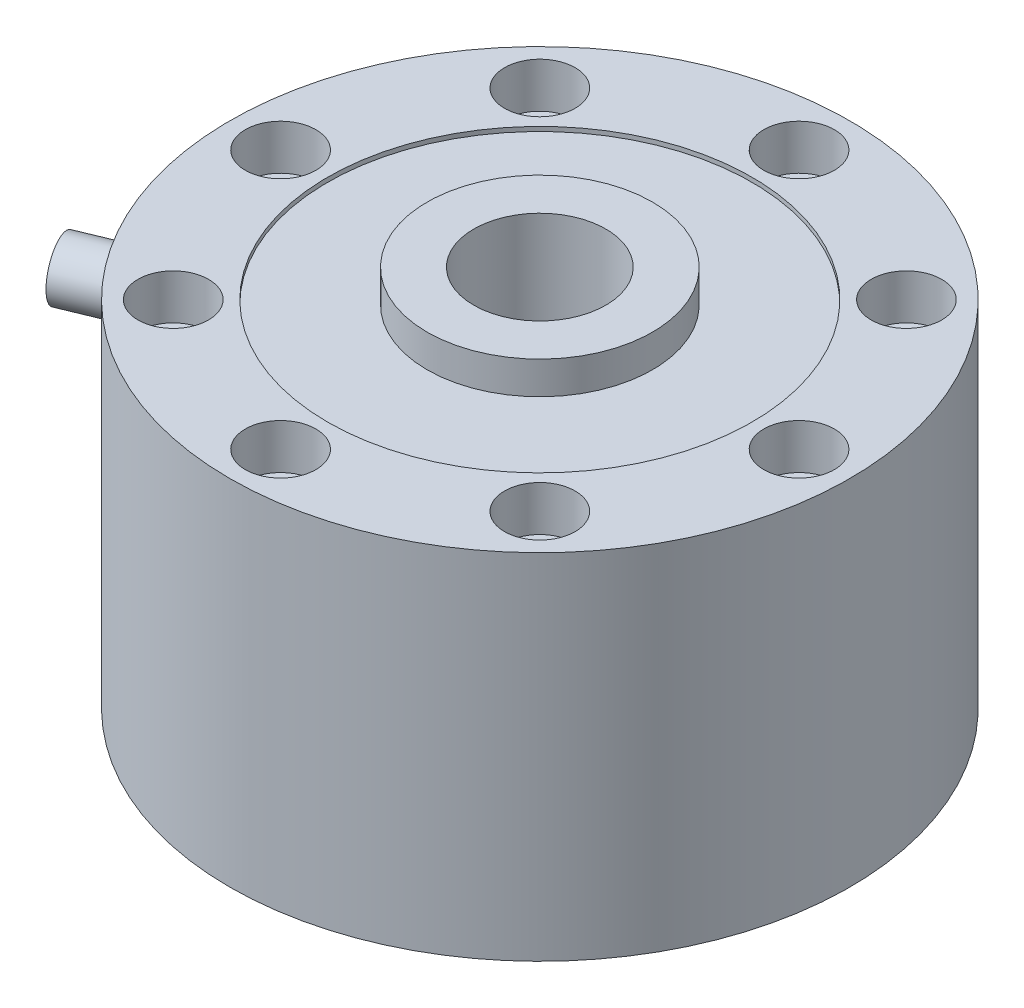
ISO-10303-21;
HEADER;
FILE_DESCRIPTION(('STEP AP214'),'2;1');
FILE_NAME('part.step','',(''),(''),'','','');
FILE_SCHEMA(('AUTOMOTIVE_DESIGN { 1 0 10303 214 1 1 1 1 }'));
ENDSEC;
DATA;
#1=APPLICATION_CONTEXT('core data for automotive mechanical design processes');
#2=APPLICATION_PROTOCOL_DEFINITION('international standard','automotive_design',2000,#1);
#3=PRODUCT_CONTEXT('',#1,'mechanical');
#4=PRODUCT('Part','Part','',(#3));
#5=PRODUCT_RELATED_PRODUCT_CATEGORY('part','',(#4));
#6=PRODUCT_DEFINITION_FORMATION('','',#4);
#7=PRODUCT_DEFINITION_CONTEXT('part definition',#1,'design');
#8=PRODUCT_DEFINITION('design','',#6,#7);
#9=PRODUCT_DEFINITION_SHAPE('','',#8);
#10=(LENGTH_UNIT() NAMED_UNIT(*) SI_UNIT(.MILLI.,.METRE.));
#11=(NAMED_UNIT(*) PLANE_ANGLE_UNIT() SI_UNIT($,.RADIAN.));
#12=(NAMED_UNIT(*) SI_UNIT($,.STERADIAN.) SOLID_ANGLE_UNIT());
#13=UNCERTAINTY_MEASURE_WITH_UNIT(LENGTH_MEASURE(1.E-05),#10,'distance_accuracy_value','');
#14=(GEOMETRIC_REPRESENTATION_CONTEXT(3) GLOBAL_UNCERTAINTY_ASSIGNED_CONTEXT((#13)) GLOBAL_UNIT_ASSIGNED_CONTEXT((#10,
#11,#12)) REPRESENTATION_CONTEXT('',''));
#15=CARTESIAN_POINT('',(0.,0.,0.));
#16=DIRECTION('',(0.,0.,1.));
#17=DIRECTION('',(1.,0.,0.));
#18=AXIS2_PLACEMENT_3D('',#15,#16,#17);
#19=CARTESIAN_POINT('',(0.,79.756,0.));
#20=DIRECTION('',(0.,-1.,0.));
#21=DIRECTION('',(0.,0.,-1.));
#22=AXIS2_PLACEMENT_3D('',#19,#20,#21);
#23=CYLINDRICAL_SURFACE('',#22,69.85);
#24=CARTESIAN_POINT('',(0.,79.756,0.));
#25=DIRECTION('',(0.,1.,0.));
#26=DIRECTION('',(0.,0.,1.));
#27=AXIS2_PLACEMENT_3D('',#24,#25,#26);
#28=CIRCLE('',#27,69.85);
#29=CARTESIAN_POINT('',(0.,79.756,69.85));
#30=VERTEX_POINT('',#29);
#31=EDGE_CURVE('E82',#30,#30,#28,.T.);
#32=ORIENTED_EDGE('',*,*,#31,.F.);
#33=EDGE_LOOP('',(#32));
#34=FACE_BOUND('',#33,.T.);
#35=CARTESIAN_POINT('',(0.,0.,0.));
#36=DIRECTION('',(0.,1.,0.));
#37=DIRECTION('',(0.,0.,1.));
#38=AXIS2_PLACEMENT_3D('',#35,#36,#37);
#39=CIRCLE('',#38,69.85);
#40=CARTESIAN_POINT('',(0.,0.,69.85));
#41=VERTEX_POINT('',#40);
#42=EDGE_CURVE('E81',#41,#41,#39,.T.);
#43=ORIENTED_EDGE('',*,*,#42,.T.);
#44=EDGE_LOOP('',(#43));
#45=FACE_BOUND('',#44,.T.);
#46=CARTESIAN_POINT('',(-66.6958066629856,63.5510919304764,20.7531172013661));
#47=CARTESIAN_POINT('',(-66.6958069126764,63.3730834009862,20.7531155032));
#48=CARTESIAN_POINT('',(-66.6935737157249,63.1951005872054,20.7602972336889));
#49=CARTESIAN_POINT('',(-66.6846432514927,62.8403461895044,20.788965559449));
#50=CARTESIAN_POINT('',(-66.6779448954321,62.6635749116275,20.810455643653));
#51=CARTESIAN_POINT('',(-66.660084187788,62.3124202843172,20.8675961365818));
#52=CARTESIAN_POINT('',(-66.6489182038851,62.1380389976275,20.9032580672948));
#53=CARTESIAN_POINT('',(-66.6221329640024,61.7929838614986,20.9884704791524));
#54=CARTESIAN_POINT('',(-66.6065120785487,61.6223113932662,21.0380260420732));
#55=CARTESIAN_POINT('',(-66.5708595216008,61.2861125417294,21.1505706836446));
#56=CARTESIAN_POINT('',(-66.5508320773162,61.1205813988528,21.2135468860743));
#57=CARTESIAN_POINT('',(-66.5063834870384,60.7956018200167,21.3524887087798));
#58=CARTESIAN_POINT('',(-66.4819607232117,60.6361556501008,21.4284591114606));
#59=CARTESIAN_POINT('',(-66.4287885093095,60.3246223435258,21.5927303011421));
#60=CARTESIAN_POINT('',(-66.4000415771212,60.1725309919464,21.6810239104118));
#61=CARTESIAN_POINT('',(-66.3382613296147,59.8766186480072,21.8693255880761));
#62=CARTESIAN_POINT('',(-66.3052264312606,59.7328007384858,21.9693379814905));
#63=CARTESIAN_POINT('',(-66.2348780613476,59.454178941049,22.1805283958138));
#64=CARTESIAN_POINT('',(-66.1975548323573,59.3193967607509,22.2917318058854));
#65=CARTESIAN_POINT('',(-66.1187820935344,59.0601124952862,22.5243030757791));
#66=CARTESIAN_POINT('',(-66.077331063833,58.9356142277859,22.64567467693));
#67=CARTESIAN_POINT('',(-65.9904600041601,58.6978686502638,22.8975856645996));
#68=CARTESIAN_POINT('',(-65.9450412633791,58.5846177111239,23.0281220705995));
#69=CARTESIAN_POINT('',(-65.8503683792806,58.3700811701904,23.2974647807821));
#70=CARTESIAN_POINT('',(-65.8011128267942,58.2687999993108,23.4362741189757));
#71=CARTESIAN_POINT('',(-65.6989080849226,58.0788412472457,23.7212756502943));
#72=CARTESIAN_POINT('',(-65.6459539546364,57.9901810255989,23.8674776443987));
#73=CARTESIAN_POINT('',(-65.5366296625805,57.8262332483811,24.1660497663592));
#74=CARTESIAN_POINT('',(-65.480258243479,57.7509506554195,24.3184221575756));
#75=CARTESIAN_POINT('',(-65.3644101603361,57.61436757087,24.6281073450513));
#76=CARTESIAN_POINT('',(-65.3049347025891,57.5530616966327,24.785418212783));
#77=CARTESIAN_POINT('',(-65.1831819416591,57.4448218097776,25.1038733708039));
#78=CARTESIAN_POINT('',(-65.120903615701,57.3978930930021,25.2650190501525));
#79=CARTESIAN_POINT('',(-64.9307895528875,57.2795202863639,25.7514142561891));
#80=CARTESIAN_POINT('',(-64.7992228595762,57.2299568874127,26.0808338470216));
#81=CARTESIAN_POINT('',(-64.5298217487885,57.1910708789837,26.7404518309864));
#82=CARTESIAN_POINT('',(-64.3919874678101,57.2017469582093,27.0706502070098));
#83=CARTESIAN_POINT('',(-64.114395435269,57.2828244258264,27.7216809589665));
#84=CARTESIAN_POINT('',(-63.9746445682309,57.3530492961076,28.0425381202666));
#85=CARTESIAN_POINT('',(-63.6972856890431,57.5509772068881,28.6669692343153));
#86=CARTESIAN_POINT('',(-63.5596777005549,57.678680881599,28.9705429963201));
#87=CARTESIAN_POINT('',(-63.2911170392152,57.9881311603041,29.5526650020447));
#88=CARTESIAN_POINT('',(-63.1601743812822,58.1699564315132,29.8311760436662));
#89=CARTESIAN_POINT('',(-62.9099384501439,58.5824329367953,30.3553394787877));
#90=CARTESIAN_POINT('',(-62.7906454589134,58.8130853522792,30.6009910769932));
#91=CARTESIAN_POINT('',(-62.5678919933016,59.3176625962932,31.0539121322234));
#92=CARTESIAN_POINT('',(-62.4644903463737,59.5917409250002,31.2610395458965));
#93=CARTESIAN_POINT('',(-62.2782312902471,60.1748562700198,31.6304813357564));
#94=CARTESIAN_POINT('',(-62.1953739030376,60.4838933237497,31.792795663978));
#95=CARTESIAN_POINT('',(-62.0536862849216,61.1282660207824,32.0684683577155));
#96=CARTESIAN_POINT('',(-61.9948598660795,61.4636058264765,32.1818189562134));
#97=CARTESIAN_POINT('',(-61.9038190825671,62.1510104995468,32.3565987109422));
#98=CARTESIAN_POINT('',(-61.8716040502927,62.503074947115,32.4180291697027));
#99=CARTESIAN_POINT('',(-61.8352840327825,63.2125878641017,32.4872544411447));
#100=CARTESIAN_POINT('',(-61.8310789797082,63.5700125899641,32.4952401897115));
#101=CARTESIAN_POINT('',(-61.8507005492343,64.2812832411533,32.4578768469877));
#102=CARTESIAN_POINT('',(-61.8745268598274,64.6351292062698,32.4125283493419));
#103=CARTESIAN_POINT('',(-61.949087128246,65.3285775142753,32.2697924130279));
#104=CARTESIAN_POINT('',(-61.9997746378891,65.668203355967,32.1724948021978));
#105=CARTESIAN_POINT('',(-62.125825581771,66.3242996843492,31.9284051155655));
#106=CARTESIAN_POINT('',(-62.2011894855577,66.6407697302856,31.7816120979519));
#107=CARTESIAN_POINT('',(-62.3736566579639,67.2425518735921,31.4417831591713));
#108=CARTESIAN_POINT('',(-62.470820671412,67.5277735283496,31.2486179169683));
#109=CARTESIAN_POINT('',(-62.6827973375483,68.0580469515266,30.8211968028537));
#110=CARTESIAN_POINT('',(-62.7976103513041,68.3030978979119,30.586940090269));
#111=CARTESIAN_POINT('',(-63.0407542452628,68.7468103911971,30.0826239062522));
#112=CARTESIAN_POINT('',(-63.1691242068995,68.9453322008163,29.8124603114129));
#113=CARTESIAN_POINT('',(-63.4342988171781,69.2893892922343,29.2439811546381));
#114=CARTESIAN_POINT('',(-63.5711033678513,69.4349251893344,28.9456659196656));
#115=CARTESIAN_POINT('',(-63.8480820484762,69.6686474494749,28.329469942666));
#116=CARTESIAN_POINT('',(-63.9882508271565,69.7569193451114,28.0116191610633));
#117=CARTESIAN_POINT('',(-64.2676366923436,69.8738618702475,27.3645247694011));
#118=CARTESIAN_POINT('',(-64.4068538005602,69.9025338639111,27.0352814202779));
#119=CARTESIAN_POINT('',(-64.6113991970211,69.9002864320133,26.5409422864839));
#120=CARTESIAN_POINT('',(-64.6787846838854,69.8920338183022,26.3762931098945));
#121=CARTESIAN_POINT('',(-64.8118019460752,69.8606304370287,26.0477278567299));
#122=CARTESIAN_POINT('',(-64.8774343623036,69.8374851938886,25.8838115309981));
#123=CARTESIAN_POINT('',(-65.0065431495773,69.7764468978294,25.5578290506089));
#124=CARTESIAN_POINT('',(-65.0700187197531,69.7385484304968,25.3957635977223));
#125=CARTESIAN_POINT('',(-65.1943883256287,69.648298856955,25.0747650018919));
#126=CARTESIAN_POINT('',(-65.2552832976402,69.5959530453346,24.9158307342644));
#127=CARTESIAN_POINT('',(-65.3741895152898,69.4771631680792,24.6021542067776));
#128=CARTESIAN_POINT('',(-65.4321999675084,69.4107152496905,24.4474131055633));
#129=CARTESIAN_POINT('',(-65.5450002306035,69.2642332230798,24.1433579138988));
#130=CARTESIAN_POINT('',(-65.5997912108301,69.1842040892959,23.9940418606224));
#131=CARTESIAN_POINT('',(-65.705936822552,69.0110818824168,23.7018257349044));
#132=CARTESIAN_POINT('',(-65.7572902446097,68.917984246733,23.5589279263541));
#133=CARTESIAN_POINT('',(-65.8563034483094,68.7194413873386,23.2807129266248));
#134=CARTESIAN_POINT('',(-65.9039645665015,68.6140006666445,23.1453929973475));
#135=CARTESIAN_POINT('',(-65.9956073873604,68.3910594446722,22.8827822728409));
#136=CARTESIAN_POINT('',(-66.0395743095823,68.2735143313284,22.7555241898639));
#137=CARTESIAN_POINT('',(-66.1234578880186,68.0275758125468,22.5106101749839));
#138=CARTESIAN_POINT('',(-66.1633760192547,67.899186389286,22.3929507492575));
#139=CARTESIAN_POINT('',(-66.2390824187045,67.6323432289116,22.1680074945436));
#140=CARTESIAN_POINT('',(-66.2748681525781,67.4938833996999,22.0607300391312));
#141=CARTESIAN_POINT('',(-66.3421732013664,67.2079957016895,21.8574933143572));
#142=CARTESIAN_POINT('',(-66.3736940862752,67.0605711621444,21.7615298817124));
#143=CARTESIAN_POINT('',(-66.4324853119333,66.7573601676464,21.5813901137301));
#144=CARTESIAN_POINT('',(-66.4597446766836,66.6015534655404,21.4972442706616));
#145=CARTESIAN_POINT('',(-66.5098503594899,66.2830856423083,21.341719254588));
#146=CARTESIAN_POINT('',(-66.5326982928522,66.1204270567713,21.2703354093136));
#147=CARTESIAN_POINT('',(-66.5739345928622,65.789491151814,21.1409164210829));
#148=CARTESIAN_POINT('',(-66.5923266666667,65.6212186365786,21.0828701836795));
#149=CARTESIAN_POINT('',(-66.6246409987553,65.2801839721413,20.9805287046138));
#150=CARTESIAN_POINT('',(-66.6385643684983,65.1074229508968,20.9362300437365));
#151=CARTESIAN_POINT('',(-66.6654201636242,64.706428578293,20.850584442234));
#152=CARTESIAN_POINT('',(-66.6768139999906,64.477041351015,20.8140726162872));
#153=CARTESIAN_POINT('',(-66.692007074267,64.0154521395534,20.765340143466));
#154=CARTESIAN_POINT('',(-66.6958063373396,63.7832501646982,20.7531194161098));
#155=CARTESIAN_POINT('',(-66.6958066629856,63.5510919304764,20.7531172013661));
#156=B_SPLINE_CURVE_WITH_KNOTS('',3,(#46,#47,#48,#49,#50,#51,#52,#53,#54,#55,#56,#57,#58,#59,
#60,#61,#62,#63,#64,#65,#66,#67,#68,#69,#70,#71,#72,#73,#74,#75,#76,#77,#78,#79,#80,#81,#82,#83,
#84,#85,#86,#87,#88,#89,#90,#91,#92,#93,#94,#95,#96,#97,#98,#99,#100,#101,#102,#103,#104,#105,
#106,#107,#108,#109,#110,#111,#112,#113,#114,#115,#116,#117,#118,#119,#120,#121,#122,#123,#124,
#125,#126,#127,#128,#129,#130,#131,#132,#133,#134,#135,#136,#137,#138,#139,#140,#141,#142,#143,
#144,#145,#146,#147,#148,#149,#150,#151,#152,#153,#154,#155),.UNSPECIFIED.,.T.,.F.,(4,2,2,2,2,2,
2,2,2,2,2,2,2,2,2,2,2,2,2,2,2,2,2,2,2,2,2,2,2,2,2,2,2,2,2,2,2,2,2,2,2,2,2,2,2,2,2,2,2,2,2,2,2,2,
4),(0.,0.533822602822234,1.06777542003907,1.60216324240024,2.13674677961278,2.67081970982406,
3.20508962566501,3.73904964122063,4.27320734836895,4.80860546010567,5.34420144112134,
5.87962403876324,6.41524421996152,6.95159414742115,7.48814262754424,8.02448412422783,
8.56102294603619,9.62995750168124,10.6988687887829,11.7646225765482,12.8303881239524,
13.8977104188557,14.9650585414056,16.0362672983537,17.1074772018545,18.1788569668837,
19.250209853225,20.3177331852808,21.385244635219,22.4509161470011,23.5166079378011,
24.585306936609,25.6540278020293,26.7259182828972,27.7977963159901,28.8680696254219,
29.9383184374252,30.4720878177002,31.0056593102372,31.539426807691,32.0729989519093,
32.6067170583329,33.1402400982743,33.673949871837,34.2074655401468,34.743023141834,
35.2783849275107,35.8140733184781,36.349563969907,36.8864118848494,37.4230628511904,
37.9592657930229,38.4953352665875,39.1915475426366,39.8877575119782),.UNSPECIFIED.);
#157=CARTESIAN_POINT('',(-66.6958066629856,63.5510919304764,20.7531172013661));
#158=VERTEX_POINT('',#157);
#159=EDGE_CURVE('E11',#158,#158,#156,.T.);
#160=ORIENTED_EDGE('',*,*,#159,.F.);
#161=EDGE_LOOP('',(#160));
#162=FACE_BOUND('',#161,.T.);
#163=ADVANCED_FACE('F35',(#34,#45,#162),#23,.T.);
#164=CARTESIAN_POINT('',(-41.3091781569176,-1.26999999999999,-41.3091781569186));
#165=DIRECTION('',(0.,1.,0.));
#166=DIRECTION('',(0.,0.,1.));
#167=AXIS2_PLACEMENT_3D('',#164,#165,#166);
#168=CYLINDRICAL_SURFACE('',#167,5.1562);
#169=CARTESIAN_POINT('',(-41.3091781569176,0.,-41.3091781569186));
#170=DIRECTION('',(0.,1.,0.));
#171=DIRECTION('',(0.,0.,1.));
#172=AXIS2_PLACEMENT_3D('',#169,#170,#171);
#173=CIRCLE('',#172,5.1562);
#174=CARTESIAN_POINT('',(-41.3091781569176,0.,-36.1529781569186));
#175=VERTEX_POINT('',#174);
#176=EDGE_CURVE('E96',#175,#175,#173,.T.);
#177=ORIENTED_EDGE('',*,*,#176,.F.);
#178=EDGE_LOOP('',(#177));
#179=FACE_BOUND('',#178,.T.);
#180=CARTESIAN_POINT('',(-41.3091781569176,69.596,-41.3091781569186));
#181=DIRECTION('',(0.,1.,0.));
#182=DIRECTION('',(0.,0.,1.));
#183=AXIS2_PLACEMENT_3D('',#180,#181,#182);
#184=CIRCLE('',#183,5.1562);
#185=CARTESIAN_POINT('',(-41.3091781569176,69.596,-36.1529781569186));
#186=VERTEX_POINT('',#185);
#187=EDGE_CURVE('E113',#186,#186,#184,.F.);
#188=ORIENTED_EDGE('',*,*,#187,.F.);
#189=EDGE_LOOP('',(#188));
#190=FACE_BOUND('',#189,.T.);
#191=ADVANCED_FACE('F178',(#179,#190),#168,.F.);
#192=CARTESIAN_POINT('',(-58.42,-1.26999999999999,-6.00394884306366E-13));
#193=DIRECTION('',(0.,1.,0.));
#194=DIRECTION('',(0.,0.,1.));
#195=AXIS2_PLACEMENT_3D('',#192,#193,#194);
#196=CYLINDRICAL_SURFACE('',#195,5.1562);
#197=CARTESIAN_POINT('',(-58.42,0.,-6.00394884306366E-13));
#198=DIRECTION('',(0.,1.,0.));
#199=DIRECTION('',(0.,0.,1.));
#200=AXIS2_PLACEMENT_3D('',#197,#198,#199);
#201=CIRCLE('',#200,5.1562);
#202=CARTESIAN_POINT('',(-58.42,0.,5.1561999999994));
#203=VERTEX_POINT('',#202);
#204=EDGE_CURVE('E128',#203,#203,#201,.T.);
#205=ORIENTED_EDGE('',*,*,#204,.F.);
#206=EDGE_LOOP('',(#205));
#207=FACE_BOUND('',#206,.T.);
#208=CARTESIAN_POINT('',(-58.42,69.596,-6.00394884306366E-13));
#209=DIRECTION('',(0.,1.,0.));
#210=DIRECTION('',(0.,0.,1.));
#211=AXIS2_PLACEMENT_3D('',#208,#209,#210);
#212=CIRCLE('',#211,5.1562);
#213=CARTESIAN_POINT('',(-58.42,69.596,5.1561999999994));
#214=VERTEX_POINT('',#213);
#215=EDGE_CURVE('E111',#214,#214,#212,.F.);
#216=ORIENTED_EDGE('',*,*,#215,.F.);
#217=EDGE_LOOP('',(#216));
#218=FACE_BOUND('',#217,.T.);
#219=ADVANCED_FACE('F183',(#207,#218),#196,.F.);
#220=CARTESIAN_POINT('',(-41.3091781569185,-1.26999999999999,41.3091781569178));
#221=DIRECTION('',(0.,1.,0.));
#222=DIRECTION('',(0.,0.,1.));
#223=AXIS2_PLACEMENT_3D('',#220,#221,#222);
#224=CYLINDRICAL_SURFACE('',#223,5.1562);
#225=CARTESIAN_POINT('',(-41.3091781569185,0.,41.3091781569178));
#226=DIRECTION('',(0.,1.,0.));
#227=DIRECTION('',(0.,0.,1.));
#228=AXIS2_PLACEMENT_3D('',#225,#226,#227);
#229=CIRCLE('',#228,5.1562);
#230=CARTESIAN_POINT('',(-41.3091781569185,0.,46.4653781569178));
#231=VERTEX_POINT('',#230);
#232=EDGE_CURVE('E131',#231,#231,#229,.T.);
#233=ORIENTED_EDGE('',*,*,#232,.F.);
#234=EDGE_LOOP('',(#233));
#235=FACE_BOUND('',#234,.T.);
#236=CARTESIAN_POINT('',(-41.3091781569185,69.596,41.3091781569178));
#237=DIRECTION('',(0.,1.,0.));
#238=DIRECTION('',(0.,0.,1.));
#239=AXIS2_PLACEMENT_3D('',#236,#237,#238);
#240=CIRCLE('',#239,5.1562);
#241=CARTESIAN_POINT('',(-41.3091781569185,69.596,46.4653781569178));
#242=VERTEX_POINT('',#241);
#243=EDGE_CURVE('E108',#242,#242,#240,.F.);
#244=ORIENTED_EDGE('',*,*,#243,.F.);
#245=EDGE_LOOP('',(#244));
#246=FACE_BOUND('',#245,.T.);
#247=ADVANCED_FACE('F284',(#235,#246),#224,.F.);
#248=CARTESIAN_POINT('',(0.,-1.26999999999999,58.42));
#249=DIRECTION('',(0.,1.,0.));
#250=DIRECTION('',(0.,0.,1.));
#251=AXIS2_PLACEMENT_3D('',#248,#249,#250);
#252=CYLINDRICAL_SURFACE('',#251,5.1562);
#253=CARTESIAN_POINT('',(0.,0.,58.42));
#254=DIRECTION('',(0.,1.,0.));
#255=DIRECTION('',(0.,0.,1.));
#256=AXIS2_PLACEMENT_3D('',#253,#254,#255);
#257=CIRCLE('',#256,5.1562);
#258=CARTESIAN_POINT('',(0.,0.,63.5762));
#259=VERTEX_POINT('',#258);
#260=EDGE_CURVE('E134',#259,#259,#257,.T.);
#261=ORIENTED_EDGE('',*,*,#260,.F.);
#262=EDGE_LOOP('',(#261));
#263=FACE_BOUND('',#262,.T.);
#264=CARTESIAN_POINT('',(0.,69.596,58.42));
#265=DIRECTION('',(0.,1.,0.));
#266=DIRECTION('',(0.,0.,1.));
#267=AXIS2_PLACEMENT_3D('',#264,#265,#266);
#268=CIRCLE('',#267,5.1562);
#269=CARTESIAN_POINT('',(0.,69.596,63.5762));
#270=VERTEX_POINT('',#269);
#271=EDGE_CURVE('E105',#270,#270,#268,.F.);
#272=ORIENTED_EDGE('',*,*,#271,.F.);
#273=EDGE_LOOP('',(#272));
#274=FACE_BOUND('',#273,.T.);
#275=ADVANCED_FACE('F280',(#263,#274),#252,.F.);
#276=CARTESIAN_POINT('',(41.3091781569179,-1.26999999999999,41.3091781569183));
#277=DIRECTION('',(0.,1.,0.));
#278=DIRECTION('',(0.,0.,1.));
#279=AXIS2_PLACEMENT_3D('',#276,#277,#278);
#280=CYLINDRICAL_SURFACE('',#279,5.1562);
#281=CARTESIAN_POINT('',(41.3091781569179,0.,41.3091781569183));
#282=DIRECTION('',(0.,1.,0.));
#283=DIRECTION('',(0.,0.,1.));
#284=AXIS2_PLACEMENT_3D('',#281,#282,#283);
#285=CIRCLE('',#284,5.1562);
#286=CARTESIAN_POINT('',(41.3091781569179,0.,46.4653781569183));
#287=VERTEX_POINT('',#286);
#288=EDGE_CURVE('E137',#287,#287,#285,.T.);
#289=ORIENTED_EDGE('',*,*,#288,.F.);
#290=EDGE_LOOP('',(#289));
#291=FACE_BOUND('',#290,.T.);
#292=CARTESIAN_POINT('',(41.3091781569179,69.596,41.3091781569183));
#293=DIRECTION('',(0.,1.,0.));
#294=DIRECTION('',(0.,0.,1.));
#295=AXIS2_PLACEMENT_3D('',#292,#293,#294);
#296=CIRCLE('',#295,5.1562);
#297=CARTESIAN_POINT('',(41.3091781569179,69.596,46.4653781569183));
#298=VERTEX_POINT('',#297);
#299=EDGE_CURVE('E101',#298,#298,#296,.F.);
#300=ORIENTED_EDGE('',*,*,#299,.F.);
#301=EDGE_LOOP('',(#300));
#302=FACE_BOUND('',#301,.T.);
#303=ADVANCED_FACE('F276',(#291,#302),#280,.F.);
#304=CARTESIAN_POINT('',(58.42,-1.26999999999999,1.92450204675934E-13));
#305=DIRECTION('',(0.,1.,0.));
#306=DIRECTION('',(0.,0.,1.));
#307=AXIS2_PLACEMENT_3D('',#304,#305,#306);
#308=CYLINDRICAL_SURFACE('',#307,5.1562);
#309=CARTESIAN_POINT('',(58.42,0.,1.92450204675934E-13));
#310=DIRECTION('',(0.,1.,0.));
#311=DIRECTION('',(0.,0.,1.));
#312=AXIS2_PLACEMENT_3D('',#309,#310,#311);
#313=CIRCLE('',#312,5.1562);
#314=CARTESIAN_POINT('',(58.42,0.,5.15620000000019));
#315=VERTEX_POINT('',#314);
#316=EDGE_CURVE('E140',#315,#315,#313,.T.);
#317=ORIENTED_EDGE('',*,*,#316,.F.);
#318=EDGE_LOOP('',(#317));
#319=FACE_BOUND('',#318,.T.);
#320=CARTESIAN_POINT('',(58.42,69.596,1.92450204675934E-13));
#321=DIRECTION('',(0.,1.,0.));
#322=DIRECTION('',(0.,0.,1.));
#323=AXIS2_PLACEMENT_3D('',#320,#321,#322);
#324=CIRCLE('',#323,5.1562);
#325=CARTESIAN_POINT('',(58.42,69.596,5.15620000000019));
#326=VERTEX_POINT('',#325);
#327=EDGE_CURVE('E98',#326,#326,#324,.F.);
#328=ORIENTED_EDGE('',*,*,#327,.F.);
#329=EDGE_LOOP('',(#328));
#330=FACE_BOUND('',#329,.T.);
#331=ADVANCED_FACE('F273',(#319,#330),#308,.F.);
#332=CARTESIAN_POINT('',(41.3091781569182,-1.26999999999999,-41.309178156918));
#333=DIRECTION('',(0.,1.,0.));
#334=DIRECTION('',(0.,0.,1.));
#335=AXIS2_PLACEMENT_3D('',#332,#333,#334);
#336=CYLINDRICAL_SURFACE('',#335,5.1562);
#337=CARTESIAN_POINT('',(41.3091781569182,0.,-41.309178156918));
#338=DIRECTION('',(0.,1.,0.));
#339=DIRECTION('',(0.,0.,1.));
#340=AXIS2_PLACEMENT_3D('',#337,#338,#339);
#341=CIRCLE('',#340,5.1562);
#342=CARTESIAN_POINT('',(41.3091781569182,0.,-36.152978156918));
#343=VERTEX_POINT('',#342);
#344=EDGE_CURVE('E143',#343,#343,#341,.T.);
#345=ORIENTED_EDGE('',*,*,#344,.F.);
#346=EDGE_LOOP('',(#345));
#347=FACE_BOUND('',#346,.T.);
#348=CARTESIAN_POINT('',(41.3091781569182,69.596,-41.309178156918));
#349=DIRECTION('',(0.,1.,0.));
#350=DIRECTION('',(0.,0.,1.));
#351=AXIS2_PLACEMENT_3D('',#348,#349,#350);
#352=CIRCLE('',#351,5.1562);
#353=CARTESIAN_POINT('',(41.3091781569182,69.596,-36.152978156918));
#354=VERTEX_POINT('',#353);
#355=EDGE_CURVE('E93',#354,#354,#352,.F.);
#356=ORIENTED_EDGE('',*,*,#355,.F.);
#357=EDGE_LOOP('',(#356));
#358=FACE_BOUND('',#357,.T.);
#359=ADVANCED_FACE('F159',(#347,#358),#336,.F.);
#360=CARTESIAN_POINT('',(0.,-1.26999999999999,-58.42));
#361=DIRECTION('',(0.,1.,0.));
#362=DIRECTION('',(0.,0.,1.));
#363=AXIS2_PLACEMENT_3D('',#360,#361,#362);
#364=CYLINDRICAL_SURFACE('',#363,5.1562);
#365=CARTESIAN_POINT('',(0.,0.,-58.42));
#366=DIRECTION('',(0.,1.,0.));
#367=DIRECTION('',(0.,0.,1.));
#368=AXIS2_PLACEMENT_3D('',#365,#366,#367);
#369=CIRCLE('',#368,5.1562);
#370=CARTESIAN_POINT('',(0.,0.,-53.2638));
#371=VERTEX_POINT('',#370);
#372=EDGE_CURVE('E69',#371,#371,#369,.T.);
#373=ORIENTED_EDGE('',*,*,#372,.F.);
#374=EDGE_LOOP('',(#373));
#375=FACE_BOUND('',#374,.T.);
#376=CARTESIAN_POINT('',(0.,69.596,-58.42));
#377=DIRECTION('',(0.,1.,0.));
#378=DIRECTION('',(0.,0.,1.));
#379=AXIS2_PLACEMENT_3D('',#376,#377,#378);
#380=CIRCLE('',#379,5.1562);
#381=CARTESIAN_POINT('',(0.,69.596,-53.2638));
#382=VERTEX_POINT('',#381);
#383=EDGE_CURVE('E89',#382,#382,#380,.F.);
#384=ORIENTED_EDGE('',*,*,#383,.F.);
#385=EDGE_LOOP('',(#384));
#386=FACE_BOUND('',#385,.T.);
#387=ADVANCED_FACE('F156',(#375,#386),#364,.F.);
#388=CARTESIAN_POINT('',(0.,0.,0.));
#389=DIRECTION('',(0.,1.,0.));
#390=DIRECTION('',(0.,0.,1.));
#391=AXIS2_PLACEMENT_3D('',#388,#389,#390);
#392=PLANE('',#391);
#393=ORIENTED_EDGE('',*,*,#316,.T.);
#394=EDGE_LOOP('',(#393));
#395=FACE_BOUND('',#394,.T.);
#396=ORIENTED_EDGE('',*,*,#288,.T.);
#397=EDGE_LOOP('',(#396));
#398=FACE_BOUND('',#397,.T.);
#399=ORIENTED_EDGE('',*,*,#260,.T.);
#400=EDGE_LOOP('',(#399));
#401=FACE_BOUND('',#400,.T.);
#402=ORIENTED_EDGE('',*,*,#232,.T.);
#403=EDGE_LOOP('',(#402));
#404=FACE_BOUND('',#403,.T.);
#405=ORIENTED_EDGE('',*,*,#204,.T.);
#406=EDGE_LOOP('',(#405));
#407=FACE_BOUND('',#406,.T.);
#408=ORIENTED_EDGE('',*,*,#176,.T.);
#409=EDGE_LOOP('',(#408));
#410=FACE_BOUND('',#409,.T.);
#411=ORIENTED_EDGE('',*,*,#344,.T.);
#412=EDGE_LOOP('',(#411));
#413=FACE_BOUND('',#412,.T.);
#414=ORIENTED_EDGE('',*,*,#372,.T.);
#415=EDGE_LOOP('',(#414));
#416=FACE_BOUND('',#415,.T.);
#417=ORIENTED_EDGE('',*,*,#42,.F.);
#418=EDGE_LOOP('',(#417));
#419=FACE_BOUND('',#418,.T.);
#420=CARTESIAN_POINT('',(0.,0.,0.));
#421=DIRECTION('',(0.,1.,0.));
#422=DIRECTION('',(0.,0.,1.));
#423=AXIS2_PLACEMENT_3D('',#420,#421,#422);
#424=CIRCLE('',#423,25.4);
#425=CARTESIAN_POINT('',(0.,0.,25.4));
#426=VERTEX_POINT('',#425);
#427=EDGE_CURVE('E46',#426,#426,#424,.F.);
#428=ORIENTED_EDGE('',*,*,#427,.F.);
#429=EDGE_LOOP('',(#428));
#430=FACE_BOUND('',#429,.T.);
#431=ADVANCED_FACE('F153',(#395,#398,#401,#404,#407,#410,#413,#416,#419,#430),#392,.F.);
#432=CARTESIAN_POINT('',(0.,79.756,0.));
#433=DIRECTION('',(0.,1.,0.));
#434=DIRECTION('',(0.,0.,1.));
#435=AXIS2_PLACEMENT_3D('',#432,#433,#434);
#436=PLANE('',#435);
#437=CARTESIAN_POINT('',(0.,79.756,0.));
#438=DIRECTION('',(0.,1.,0.));
#439=DIRECTION('',(0.,0.,1.));
#440=AXIS2_PLACEMENT_3D('',#437,#438,#439);
#441=CIRCLE('',#440,47.8187092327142);
#442=CARTESIAN_POINT('',(0.,79.756,47.8187092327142));
#443=VERTEX_POINT('',#442);
#444=EDGE_CURVE('E336',#443,#443,#441,.T.);
#445=ORIENTED_EDGE('',*,*,#444,.F.);
#446=EDGE_LOOP('',(#445));
#447=FACE_BOUND('',#446,.T.);
#448=CARTESIAN_POINT('',(58.42,79.756,1.92450204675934E-13));
#449=DIRECTION('',(0.,1.,0.));
#450=DIRECTION('',(-1.,0.,0.));
#451=AXIS2_PLACEMENT_3D('',#448,#449,#450);
#452=CIRCLE('',#451,7.9502);
#453=CARTESIAN_POINT('',(50.4698,79.756,1.64692229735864E-13));
#454=VERTEX_POINT('',#453);
#455=EDGE_CURVE('E350',#454,#454,#452,.T.);
#456=ORIENTED_EDGE('',*,*,#455,.F.);
#457=EDGE_LOOP('',(#456));
#458=FACE_BOUND('',#457,.T.);
#459=CARTESIAN_POINT('',(41.3091781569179,79.756,41.3091781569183));
#460=DIRECTION('',(0.,1.,0.));
#461=DIRECTION('',(-0.707106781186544,0.,-0.707106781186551));
#462=AXIS2_PLACEMENT_3D('',#459,#460,#461);
#463=CIRCLE('',#462,7.9502);
#464=CARTESIAN_POINT('',(35.6875378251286,79.756,35.687537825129));
#465=VERTEX_POINT('',#464);
#466=EDGE_CURVE('E356',#465,#465,#463,.T.);
#467=ORIENTED_EDGE('',*,*,#466,.F.);
#468=EDGE_LOOP('',(#467));
#469=FACE_BOUND('',#468,.T.);
#470=CARTESIAN_POINT('',(0.,79.756,58.42));
#471=DIRECTION('',(0.,1.,0.));
#472=DIRECTION('',(0.,0.,-1.));
#473=AXIS2_PLACEMENT_3D('',#470,#471,#472);
#474=CIRCLE('',#473,7.9502);
#475=CARTESIAN_POINT('',(0.,79.756,50.4698));
#476=VERTEX_POINT('',#475);
#477=EDGE_CURVE('E362',#476,#476,#474,.T.);
#478=ORIENTED_EDGE('',*,*,#477,.F.);
#479=EDGE_LOOP('',(#478));
#480=FACE_BOUND('',#479,.T.);
#481=CARTESIAN_POINT('',(-41.3091781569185,79.756,41.3091781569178));
#482=DIRECTION('',(0.,1.,0.));
#483=DIRECTION('',(0.707106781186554,0.,-0.707106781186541));
#484=AXIS2_PLACEMENT_3D('',#481,#482,#483);
#485=CIRCLE('',#484,7.9502);
#486=CARTESIAN_POINT('',(-35.6875378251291,79.756,35.6875378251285));
#487=VERTEX_POINT('',#486);
#488=EDGE_CURVE('E368',#487,#487,#485,.T.);
#489=ORIENTED_EDGE('',*,*,#488,.F.);
#490=EDGE_LOOP('',(#489));
#491=FACE_BOUND('',#490,.T.);
#492=CARTESIAN_POINT('',(-58.42,79.756,-6.00394884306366E-13));
#493=DIRECTION('',(0.,1.,0.));
#494=DIRECTION('',(1.,0.,0.));
#495=AXIS2_PLACEMENT_3D('',#492,#493,#494);
#496=CIRCLE('',#495,7.9502);
#497=CARTESIAN_POINT('',(-50.4698,79.756,-5.17120959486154E-13));
#498=VERTEX_POINT('',#497);
#499=EDGE_CURVE('E374',#498,#498,#496,.T.);
#500=ORIENTED_EDGE('',*,*,#499,.F.);
#501=EDGE_LOOP('',(#500));
#502=FACE_BOUND('',#501,.T.);
#503=CARTESIAN_POINT('',(-41.3091781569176,79.756,-41.3091781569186));
#504=DIRECTION('',(0.,1.,0.));
#505=DIRECTION('',(0.707106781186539,0.,0.707106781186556));
#506=AXIS2_PLACEMENT_3D('',#503,#504,#505);
#507=CIRCLE('',#506,7.9502);
#508=CARTESIAN_POINT('',(-35.6875378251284,79.756,-35.6875378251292));
#509=VERTEX_POINT('',#508);
#510=EDGE_CURVE('E346',#509,#509,#507,.T.);
#511=ORIENTED_EDGE('',*,*,#510,.F.);
#512=EDGE_LOOP('',(#511));
#513=FACE_BOUND('',#512,.T.);
#514=CARTESIAN_POINT('',(41.3091781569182,79.756,-41.309178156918));
#515=DIRECTION('',(0.,1.,0.));
#516=DIRECTION('',(-0.707106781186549,0.,0.707106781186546));
#517=AXIS2_PLACEMENT_3D('',#514,#515,#516);
#518=CIRCLE('',#517,7.9502);
#519=CARTESIAN_POINT('',(35.6875378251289,79.756,-35.6875378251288));
#520=VERTEX_POINT('',#519);
#521=EDGE_CURVE('E115',#520,#520,#518,.T.);
#522=ORIENTED_EDGE('',*,*,#521,.F.);
#523=EDGE_LOOP('',(#522));
#524=FACE_BOUND('',#523,.T.);
#525=CARTESIAN_POINT('',(0.,79.756,-58.42));
#526=DIRECTION('',(0.,1.,0.));
#527=DIRECTION('',(0.,0.,1.));
#528=AXIS2_PLACEMENT_3D('',#525,#526,#527);
#529=CIRCLE('',#528,7.9502);
#530=CARTESIAN_POINT('',(0.,79.756,-50.4698));
#531=VERTEX_POINT('',#530);
#532=EDGE_CURVE('E146',#531,#531,#529,.T.);
#533=ORIENTED_EDGE('',*,*,#532,.F.);
#534=EDGE_LOOP('',(#533));
#535=FACE_BOUND('',#534,.T.);
#536=ORIENTED_EDGE('',*,*,#31,.T.);
#537=EDGE_LOOP('',(#536));
#538=FACE_BOUND('',#537,.T.);
#539=ADVANCED_FACE('F301',(#447,#458,#469,#480,#491,#502,#513,#524,#535,#538),#436,.T.);
#540=CARTESIAN_POINT('',(0.,-1.27,0.));
#541=DIRECTION('',(0.,1.,0.));
#542=DIRECTION('',(0.,0.,1.));
#543=AXIS2_PLACEMENT_3D('',#540,#541,#542);
#544=CYLINDRICAL_SURFACE('',#543,25.4);
#545=CARTESIAN_POINT('',(0.,-1.27,0.));
#546=DIRECTION('',(0.,-1.,0.));
#547=DIRECTION('',(0.,0.,-1.));
#548=AXIS2_PLACEMENT_3D('',#545,#546,#547);
#549=CIRCLE('',#548,25.4);
#550=CARTESIAN_POINT('',(0.,-1.27,-25.4));
#551=VERTEX_POINT('',#550);
#552=EDGE_CURVE('E75',#551,#551,#549,.T.);
#553=ORIENTED_EDGE('',*,*,#552,.F.);
#554=EDGE_LOOP('',(#553));
#555=FACE_BOUND('',#554,.T.);
#556=ORIENTED_EDGE('',*,*,#427,.T.);
#557=EDGE_LOOP('',(#556));
#558=FACE_BOUND('',#557,.T.);
#559=ADVANCED_FACE('F306',(#555,#558),#544,.T.);
#560=CARTESIAN_POINT('',(0.,-1.27,0.));
#561=DIRECTION('',(0.,-1.,0.));
#562=DIRECTION('',(0.,0.,-1.));
#563=AXIS2_PLACEMENT_3D('',#560,#561,#562);
#564=PLANE('',#563);
#565=CARTESIAN_POINT('',(0.,-1.27,0.));
#566=DIRECTION('',(0.,-1.,0.));
#567=DIRECTION('',(0.,0.,-1.));
#568=AXIS2_PLACEMENT_3D('',#565,#566,#567);
#569=CIRCLE('',#568,14.88313);
#570=CARTESIAN_POINT('',(0.,-1.27,-14.88313));
#571=VERTEX_POINT('',#570);
#572=EDGE_CURVE('E63',#571,#571,#569,.T.);
#573=ORIENTED_EDGE('',*,*,#572,.F.);
#574=EDGE_LOOP('',(#573));
#575=FACE_BOUND('',#574,.T.);
#576=ORIENTED_EDGE('',*,*,#552,.T.);
#577=EDGE_LOOP('',(#576));
#578=FACE_BOUND('',#577,.T.);
#579=ADVANCED_FACE('F56',(#575,#578),#564,.T.);
#580=CARTESIAN_POINT('',(0.,29.21,0.));
#581=DIRECTION('',(0.,-1.,0.));
#582=DIRECTION('',(0.,0.,-1.));
#583=AXIS2_PLACEMENT_3D('',#580,#581,#582);
#584=CONICAL_SURFACE('',#583,14.88313,1.02974425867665);
#585=CARTESIAN_POINT('',(0.,38.1526867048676,0.));
#586=VERTEX_POINT('',#585);
#587=VERTEX_LOOP('',#586);
#588=FACE_BOUND('',#587,.T.);
#589=CARTESIAN_POINT('',(0.,29.21,0.));
#590=DIRECTION('',(0.,-1.,0.));
#591=DIRECTION('',(0.,0.,-1.));
#592=AXIS2_PLACEMENT_3D('',#589,#590,#591);
#593=CIRCLE('',#592,14.88313);
#594=CARTESIAN_POINT('',(0.,29.21,-14.88313));
#595=VERTEX_POINT('',#594);
#596=EDGE_CURVE('E60',#595,#595,#593,.T.);
#597=ORIENTED_EDGE('',*,*,#596,.T.);
#598=EDGE_LOOP('',(#597));
#599=FACE_BOUND('',#598,.T.);
#600=ADVANCED_FACE('F52',(#588,#599),#584,.F.);
#601=CARTESIAN_POINT('',(0.,-1.27,0.));
#602=DIRECTION('',(0.,-1.,0.));
#603=DIRECTION('',(0.,0.,-1.));
#604=AXIS2_PLACEMENT_3D('',#601,#602,#603);
#605=CYLINDRICAL_SURFACE('',#604,14.88313);
#606=ORIENTED_EDGE('',*,*,#596,.F.);
#607=EDGE_LOOP('',(#606));
#608=FACE_BOUND('',#607,.T.);
#609=ORIENTED_EDGE('',*,*,#572,.T.);
#610=EDGE_LOOP('',(#609));
#611=FACE_BOUND('',#610,.T.);
#612=ADVANCED_FACE('F55',(#608,#611),#605,.F.);
#613=CARTESIAN_POINT('',(0.,69.596,-58.42));
#614=DIRECTION('',(0.,1.,0.));
#615=DIRECTION('',(0.,0.,1.));
#616=AXIS2_PLACEMENT_3D('',#613,#614,#615);
#617=PLANE('',#616);
#618=CARTESIAN_POINT('',(0.,69.596,-58.42));
#619=DIRECTION('',(0.,1.,0.));
#620=DIRECTION('',(0.,0.,1.));
#621=AXIS2_PLACEMENT_3D('',#618,#619,#620);
#622=CIRCLE('',#621,7.9502);
#623=CARTESIAN_POINT('',(0.,69.596,-50.4698));
#624=VERTEX_POINT('',#623);
#625=EDGE_CURVE('E92',#624,#624,#622,.T.);
#626=ORIENTED_EDGE('',*,*,#625,.T.);
#627=EDGE_LOOP('',(#626));
#628=FACE_BOUND('',#627,.T.);
#629=ORIENTED_EDGE('',*,*,#383,.T.);
#630=EDGE_LOOP('',(#629));
#631=FACE_BOUND('',#630,.T.);
#632=ADVANCED_FACE('F163',(#628,#631),#617,.T.);
#633=CARTESIAN_POINT('',(0.,69.596,-58.42));
#634=DIRECTION('',(0.,1.,0.));
#635=DIRECTION('',(0.,0.,1.));
#636=AXIS2_PLACEMENT_3D('',#633,#634,#635);
#637=CYLINDRICAL_SURFACE('',#636,7.9502);
#638=ORIENTED_EDGE('',*,*,#625,.F.);
#639=EDGE_LOOP('',(#638));
#640=FACE_BOUND('',#639,.T.);
#641=ORIENTED_EDGE('',*,*,#532,.T.);
#642=EDGE_LOOP('',(#641));
#643=FACE_BOUND('',#642,.T.);
#644=ADVANCED_FACE('F165',(#640,#643),#637,.F.);
#645=CARTESIAN_POINT('',(41.3091781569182,69.596,-41.309178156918));
#646=DIRECTION('',(0.,1.,0.));
#647=DIRECTION('',(-0.707106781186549,0.,0.707106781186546));
#648=AXIS2_PLACEMENT_3D('',#645,#646,#647);
#649=PLANE('',#648);
#650=CARTESIAN_POINT('',(41.3091781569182,69.596,-41.309178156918));
#651=DIRECTION('',(0.,1.,0.));
#652=DIRECTION('',(-0.707106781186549,0.,0.707106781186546));
#653=AXIS2_PLACEMENT_3D('',#650,#651,#652);
#654=CIRCLE('',#653,7.9502);
#655=CARTESIAN_POINT('',(35.6875378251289,69.596,-35.6875378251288));
#656=VERTEX_POINT('',#655);
#657=EDGE_CURVE('E97',#656,#656,#654,.T.);
#658=ORIENTED_EDGE('',*,*,#657,.T.);
#659=EDGE_LOOP('',(#658));
#660=FACE_BOUND('',#659,.T.);
#661=ORIENTED_EDGE('',*,*,#355,.T.);
#662=EDGE_LOOP('',(#661));
#663=FACE_BOUND('',#662,.T.);
#664=ADVANCED_FACE('F172',(#660,#663),#649,.T.);
#665=CARTESIAN_POINT('',(41.3091781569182,69.596,-41.309178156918));
#666=DIRECTION('',(0.,1.,0.));
#667=DIRECTION('',(0.,0.,1.));
#668=AXIS2_PLACEMENT_3D('',#665,#666,#667);
#669=CYLINDRICAL_SURFACE('',#668,7.9502);
#670=ORIENTED_EDGE('',*,*,#657,.F.);
#671=EDGE_LOOP('',(#670));
#672=FACE_BOUND('',#671,.T.);
#673=ORIENTED_EDGE('',*,*,#521,.T.);
#674=EDGE_LOOP('',(#673));
#675=FACE_BOUND('',#674,.T.);
#676=ADVANCED_FACE('F223',(#672,#675),#669,.F.);
#677=CARTESIAN_POINT('',(58.42,69.596,1.92450204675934E-13));
#678=DIRECTION('',(0.,1.,0.));
#679=DIRECTION('',(-1.,0.,0.));
#680=AXIS2_PLACEMENT_3D('',#677,#678,#679);
#681=PLANE('',#680);
#682=CARTESIAN_POINT('',(58.42,69.596,1.92450204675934E-13));
#683=DIRECTION('',(0.,1.,0.));
#684=DIRECTION('',(-1.,0.,0.));
#685=AXIS2_PLACEMENT_3D('',#682,#683,#684);
#686=CIRCLE('',#685,7.9502);
#687=CARTESIAN_POINT('',(50.4698,69.596,1.64692229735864E-13));
#688=VERTEX_POINT('',#687);
#689=EDGE_CURVE('E102',#688,#688,#686,.T.);
#690=ORIENTED_EDGE('',*,*,#689,.T.);
#691=EDGE_LOOP('',(#690));
#692=FACE_BOUND('',#691,.T.);
#693=ORIENTED_EDGE('',*,*,#327,.T.);
#694=EDGE_LOOP('',(#693));
#695=FACE_BOUND('',#694,.T.);
#696=ADVANCED_FACE('F219',(#692,#695),#681,.T.);
#697=CARTESIAN_POINT('',(58.42,69.596,1.92450204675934E-13));
#698=DIRECTION('',(0.,1.,0.));
#699=DIRECTION('',(0.,0.,1.));
#700=AXIS2_PLACEMENT_3D('',#697,#698,#699);
#701=CYLINDRICAL_SURFACE('',#700,7.9502);
#702=ORIENTED_EDGE('',*,*,#689,.F.);
#703=EDGE_LOOP('',(#702));
#704=FACE_BOUND('',#703,.T.);
#705=ORIENTED_EDGE('',*,*,#455,.T.);
#706=EDGE_LOOP('',(#705));
#707=FACE_BOUND('',#706,.T.);
#708=ADVANCED_FACE('F222',(#704,#707),#701,.F.);
#709=CARTESIAN_POINT('',(41.3091781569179,69.596,41.3091781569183));
#710=DIRECTION('',(0.,1.,0.));
#711=DIRECTION('',(-0.707106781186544,0.,-0.707106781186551));
#712=AXIS2_PLACEMENT_3D('',#709,#710,#711);
#713=PLANE('',#712);
#714=CARTESIAN_POINT('',(41.3091781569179,69.596,41.3091781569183));
#715=DIRECTION('',(0.,1.,0.));
#716=DIRECTION('',(-0.707106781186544,0.,-0.707106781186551));
#717=AXIS2_PLACEMENT_3D('',#714,#715,#716);
#718=CIRCLE('',#717,7.9502);
#719=CARTESIAN_POINT('',(35.6875378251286,69.596,35.687537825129));
#720=VERTEX_POINT('',#719);
#721=EDGE_CURVE('E353',#720,#720,#718,.T.);
#722=ORIENTED_EDGE('',*,*,#721,.T.);
#723=EDGE_LOOP('',(#722));
#724=FACE_BOUND('',#723,.T.);
#725=ORIENTED_EDGE('',*,*,#299,.T.);
#726=EDGE_LOOP('',(#725));
#727=FACE_BOUND('',#726,.T.);
#728=ADVANCED_FACE('F227',(#724,#727),#713,.T.);
#729=CARTESIAN_POINT('',(41.3091781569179,69.596,41.3091781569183));
#730=DIRECTION('',(0.,1.,0.));
#731=DIRECTION('',(0.,0.,1.));
#732=AXIS2_PLACEMENT_3D('',#729,#730,#731);
#733=CYLINDRICAL_SURFACE('',#732,7.9502);
#734=ORIENTED_EDGE('',*,*,#721,.F.);
#735=EDGE_LOOP('',(#734));
#736=FACE_BOUND('',#735,.T.);
#737=ORIENTED_EDGE('',*,*,#466,.T.);
#738=EDGE_LOOP('',(#737));
#739=FACE_BOUND('',#738,.T.);
#740=ADVANCED_FACE('F231',(#736,#739),#733,.F.);
#741=CARTESIAN_POINT('',(0.,69.596,58.42));
#742=DIRECTION('',(0.,1.,0.));
#743=DIRECTION('',(0.,0.,-1.));
#744=AXIS2_PLACEMENT_3D('',#741,#742,#743);
#745=PLANE('',#744);
#746=CARTESIAN_POINT('',(0.,69.596,58.42));
#747=DIRECTION('',(0.,1.,0.));
#748=DIRECTION('',(0.,0.,-1.));
#749=AXIS2_PLACEMENT_3D('',#746,#747,#748);
#750=CIRCLE('',#749,7.9502);
#751=CARTESIAN_POINT('',(0.,69.596,50.4698));
#752=VERTEX_POINT('',#751);
#753=EDGE_CURVE('E359',#752,#752,#750,.T.);
#754=ORIENTED_EDGE('',*,*,#753,.T.);
#755=EDGE_LOOP('',(#754));
#756=FACE_BOUND('',#755,.T.);
#757=ORIENTED_EDGE('',*,*,#271,.T.);
#758=EDGE_LOOP('',(#757));
#759=FACE_BOUND('',#758,.T.);
#760=ADVANCED_FACE('F235',(#756,#759),#745,.T.);
#761=CARTESIAN_POINT('',(0.,69.596,58.42));
#762=DIRECTION('',(0.,1.,0.));
#763=DIRECTION('',(0.,0.,1.));
#764=AXIS2_PLACEMENT_3D('',#761,#762,#763);
#765=CYLINDRICAL_SURFACE('',#764,7.9502);
#766=ORIENTED_EDGE('',*,*,#753,.F.);
#767=EDGE_LOOP('',(#766));
#768=FACE_BOUND('',#767,.T.);
#769=ORIENTED_EDGE('',*,*,#477,.T.);
#770=EDGE_LOOP('',(#769));
#771=FACE_BOUND('',#770,.T.);
#772=ADVANCED_FACE('F239',(#768,#771),#765,.F.);
#773=CARTESIAN_POINT('',(-41.3091781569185,69.596,41.3091781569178));
#774=DIRECTION('',(0.,1.,0.));
#775=DIRECTION('',(0.707106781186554,0.,-0.707106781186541));
#776=AXIS2_PLACEMENT_3D('',#773,#774,#775);
#777=PLANE('',#776);
#778=CARTESIAN_POINT('',(-41.3091781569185,69.596,41.3091781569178));
#779=DIRECTION('',(0.,1.,0.));
#780=DIRECTION('',(0.707106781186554,0.,-0.707106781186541));
#781=AXIS2_PLACEMENT_3D('',#778,#779,#780);
#782=CIRCLE('',#781,7.9502);
#783=CARTESIAN_POINT('',(-35.6875378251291,69.596,35.6875378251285));
#784=VERTEX_POINT('',#783);
#785=EDGE_CURVE('E365',#784,#784,#782,.T.);
#786=ORIENTED_EDGE('',*,*,#785,.T.);
#787=EDGE_LOOP('',(#786));
#788=FACE_BOUND('',#787,.T.);
#789=ORIENTED_EDGE('',*,*,#243,.T.);
#790=EDGE_LOOP('',(#789));
#791=FACE_BOUND('',#790,.T.);
#792=ADVANCED_FACE('F243',(#788,#791),#777,.T.);
#793=CARTESIAN_POINT('',(-41.3091781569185,69.596,41.3091781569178));
#794=DIRECTION('',(0.,1.,0.));
#795=DIRECTION('',(0.,0.,1.));
#796=AXIS2_PLACEMENT_3D('',#793,#794,#795);
#797=CYLINDRICAL_SURFACE('',#796,7.9502);
#798=ORIENTED_EDGE('',*,*,#785,.F.);
#799=EDGE_LOOP('',(#798));
#800=FACE_BOUND('',#799,.T.);
#801=ORIENTED_EDGE('',*,*,#488,.T.);
#802=EDGE_LOOP('',(#801));
#803=FACE_BOUND('',#802,.T.);
#804=ADVANCED_FACE('F247',(#800,#803),#797,.F.);
#805=CARTESIAN_POINT('',(-58.42,69.596,-6.00394884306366E-13));
#806=DIRECTION('',(0.,1.,0.));
#807=DIRECTION('',(1.,0.,0.));
#808=AXIS2_PLACEMENT_3D('',#805,#806,#807);
#809=PLANE('',#808);
#810=CARTESIAN_POINT('',(-58.42,69.596,-6.00394884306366E-13));
#811=DIRECTION('',(0.,1.,0.));
#812=DIRECTION('',(1.,0.,0.));
#813=AXIS2_PLACEMENT_3D('',#810,#811,#812);
#814=CIRCLE('',#813,7.9502);
#815=CARTESIAN_POINT('',(-50.4698,69.596,-5.17120959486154E-13));
#816=VERTEX_POINT('',#815);
#817=EDGE_CURVE('E371',#816,#816,#814,.T.);
#818=ORIENTED_EDGE('',*,*,#817,.T.);
#819=EDGE_LOOP('',(#818));
#820=FACE_BOUND('',#819,.T.);
#821=ORIENTED_EDGE('',*,*,#215,.T.);
#822=EDGE_LOOP('',(#821));
#823=FACE_BOUND('',#822,.T.);
#824=ADVANCED_FACE('F251',(#820,#823),#809,.T.);
#825=CARTESIAN_POINT('',(-58.42,69.596,-6.00394884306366E-13));
#826=DIRECTION('',(0.,1.,0.));
#827=DIRECTION('',(0.,0.,1.));
#828=AXIS2_PLACEMENT_3D('',#825,#826,#827);
#829=CYLINDRICAL_SURFACE('',#828,7.9502);
#830=ORIENTED_EDGE('',*,*,#817,.F.);
#831=EDGE_LOOP('',(#830));
#832=FACE_BOUND('',#831,.T.);
#833=ORIENTED_EDGE('',*,*,#499,.T.);
#834=EDGE_LOOP('',(#833));
#835=FACE_BOUND('',#834,.T.);
#836=ADVANCED_FACE('F255',(#832,#835),#829,.F.);
#837=CARTESIAN_POINT('',(-41.3091781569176,69.596,-41.3091781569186));
#838=DIRECTION('',(0.,1.,0.));
#839=DIRECTION('',(0.707106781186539,0.,0.707106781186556));
#840=AXIS2_PLACEMENT_3D('',#837,#838,#839);
#841=PLANE('',#840);
#842=CARTESIAN_POINT('',(-41.3091781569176,69.596,-41.3091781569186));
#843=DIRECTION('',(0.,1.,0.));
#844=DIRECTION('',(0.707106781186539,0.,0.707106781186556));
#845=AXIS2_PLACEMENT_3D('',#842,#843,#844);
#846=CIRCLE('',#845,7.9502);
#847=CARTESIAN_POINT('',(-35.6875378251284,69.596,-35.6875378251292));
#848=VERTEX_POINT('',#847);
#849=EDGE_CURVE('E377',#848,#848,#846,.T.);
#850=ORIENTED_EDGE('',*,*,#849,.T.);
#851=EDGE_LOOP('',(#850));
#852=FACE_BOUND('',#851,.T.);
#853=ORIENTED_EDGE('',*,*,#187,.T.);
#854=EDGE_LOOP('',(#853));
#855=FACE_BOUND('',#854,.T.);
#856=ADVANCED_FACE('F259',(#852,#855),#841,.T.);
#857=CARTESIAN_POINT('',(-41.3091781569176,69.596,-41.3091781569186));
#858=DIRECTION('',(0.,1.,0.));
#859=DIRECTION('',(0.,0.,1.));
#860=AXIS2_PLACEMENT_3D('',#857,#858,#859);
#861=CYLINDRICAL_SURFACE('',#860,7.9502);
#862=ORIENTED_EDGE('',*,*,#849,.F.);
#863=EDGE_LOOP('',(#862));
#864=FACE_BOUND('',#863,.T.);
#865=ORIENTED_EDGE('',*,*,#510,.T.);
#866=EDGE_LOOP('',(#865));
#867=FACE_BOUND('',#866,.T.);
#868=ADVANCED_FACE('F217',(#864,#867),#861,.F.);
#869=CARTESIAN_POINT('',(0.,78.756,0.));
#870=DIRECTION('',(0.,1.,0.));
#871=DIRECTION('',(0.,0.,1.));
#872=AXIS2_PLACEMENT_3D('',#869,#870,#871);
#873=CYLINDRICAL_SURFACE('',#872,47.8187092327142);
#874=CARTESIAN_POINT('',(0.,78.756,0.));
#875=DIRECTION('',(0.,1.,0.));
#876=DIRECTION('',(0.,0.,1.));
#877=AXIS2_PLACEMENT_3D('',#874,#875,#876);
#878=CIRCLE('',#877,47.8187092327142);
#879=CARTESIAN_POINT('',(0.,78.756,47.8187092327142));
#880=VERTEX_POINT('',#879);
#881=EDGE_CURVE('E340',#880,#880,#878,.T.);
#882=ORIENTED_EDGE('',*,*,#881,.F.);
#883=EDGE_LOOP('',(#882));
#884=FACE_BOUND('',#883,.T.);
#885=ORIENTED_EDGE('',*,*,#444,.T.);
#886=EDGE_LOOP('',(#885));
#887=FACE_BOUND('',#886,.T.);
#888=ADVANCED_FACE('F213',(#884,#887),#873,.F.);
#889=CARTESIAN_POINT('',(0.,78.756,0.));
#890=DIRECTION('',(0.,1.,0.));
#891=DIRECTION('',(0.,0.,1.));
#892=AXIS2_PLACEMENT_3D('',#889,#890,#891);
#893=PLANE('',#892);
#894=CARTESIAN_POINT('',(0.,78.756,0.));
#895=DIRECTION('',(0.,1.,0.));
#896=DIRECTION('',(0.,0.,1.));
#897=AXIS2_PLACEMENT_3D('',#894,#895,#896);
#898=CIRCLE('',#897,25.4);
#899=CARTESIAN_POINT('',(0.,78.756,25.4));
#900=VERTEX_POINT('',#899);
#901=EDGE_CURVE('E335',#900,#900,#898,.T.);
#902=ORIENTED_EDGE('',*,*,#901,.F.);
#903=EDGE_LOOP('',(#902));
#904=FACE_BOUND('',#903,.T.);
#905=ORIENTED_EDGE('',*,*,#881,.T.);
#906=EDGE_LOOP('',(#905));
#907=FACE_BOUND('',#906,.T.);
#908=ADVANCED_FACE('F209',(#904,#907),#893,.T.);
#909=CARTESIAN_POINT('',(0.,48.006,0.));
#910=DIRECTION('',(0.,1.,0.));
#911=DIRECTION('',(0.,0.,1.));
#912=AXIS2_PLACEMENT_3D('',#909,#910,#911);
#913=CONICAL_SURFACE('',#912,14.88313,1.02974425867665);
#914=CARTESIAN_POINT('',(0.,39.0633132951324,0.));
#915=VERTEX_POINT('',#914);
#916=VERTEX_LOOP('',#915);
#917=FACE_BOUND('',#916,.T.);
#918=CARTESIAN_POINT('',(0.,48.006,0.));
#919=DIRECTION('',(0.,1.,0.));
#920=DIRECTION('',(0.,0.,1.));
#921=AXIS2_PLACEMENT_3D('',#918,#919,#920);
#922=CIRCLE('',#921,14.88313);
#923=CARTESIAN_POINT('',(0.,48.006,14.88313));
#924=VERTEX_POINT('',#923);
#925=EDGE_CURVE('E66',#924,#924,#922,.T.);
#926=ORIENTED_EDGE('',*,*,#925,.T.);
#927=EDGE_LOOP('',(#926));
#928=FACE_BOUND('',#927,.T.);
#929=ADVANCED_FACE('F212',(#917,#928),#913,.F.);
#930=CARTESIAN_POINT('',(0.,86.106,0.));
#931=DIRECTION('',(0.,1.,0.));
#932=DIRECTION('',(0.,0.,1.));
#933=AXIS2_PLACEMENT_3D('',#930,#931,#932);
#934=CYLINDRICAL_SURFACE('',#933,14.88313);
#935=ORIENTED_EDGE('',*,*,#925,.F.);
#936=EDGE_LOOP('',(#935));
#937=FACE_BOUND('',#936,.T.);
#938=CARTESIAN_POINT('',(0.,86.106,0.));
#939=DIRECTION('',(0.,1.,0.));
#940=DIRECTION('',(0.,0.,1.));
#941=AXIS2_PLACEMENT_3D('',#938,#939,#940);
#942=CIRCLE('',#941,14.88313);
#943=CARTESIAN_POINT('',(0.,86.106,14.88313));
#944=VERTEX_POINT('',#943);
#945=EDGE_CURVE('E62',#944,#944,#942,.T.);
#946=ORIENTED_EDGE('',*,*,#945,.T.);
#947=EDGE_LOOP('',(#946));
#948=FACE_BOUND('',#947,.T.);
#949=ADVANCED_FACE('F313',(#937,#948),#934,.F.);
#950=CARTESIAN_POINT('',(0.,86.106,0.));
#951=DIRECTION('',(0.,1.,0.));
#952=DIRECTION('',(0.,0.,1.));
#953=AXIS2_PLACEMENT_3D('',#950,#951,#952);
#954=PLANE('',#953);
#955=ORIENTED_EDGE('',*,*,#945,.F.);
#956=EDGE_LOOP('',(#955));
#957=FACE_BOUND('',#956,.T.);
#958=CARTESIAN_POINT('',(0.,86.106,0.));
#959=DIRECTION('',(0.,1.,0.));
#960=DIRECTION('',(0.,0.,1.));
#961=AXIS2_PLACEMENT_3D('',#958,#959,#960);
#962=CIRCLE('',#961,25.4);
#963=CARTESIAN_POINT('',(0.,86.106,25.4));
#964=VERTEX_POINT('',#963);
#965=EDGE_CURVE('E78',#964,#964,#962,.T.);
#966=ORIENTED_EDGE('',*,*,#965,.T.);
#967=EDGE_LOOP('',(#966));
#968=FACE_BOUND('',#967,.T.);
#969=ADVANCED_FACE('F203',(#957,#968),#954,.T.);
#970=CARTESIAN_POINT('',(0.,86.106,0.));
#971=DIRECTION('',(0.,-1.,0.));
#972=DIRECTION('',(0.,0.,-1.));
#973=AXIS2_PLACEMENT_3D('',#970,#971,#972);
#974=CYLINDRICAL_SURFACE('',#973,25.4);
#975=ORIENTED_EDGE('',*,*,#965,.F.);
#976=EDGE_LOOP('',(#975));
#977=FACE_BOUND('',#976,.T.);
#978=ORIENTED_EDGE('',*,*,#901,.T.);
#979=EDGE_LOOP('',(#978));
#980=FACE_BOUND('',#979,.T.);
#981=ADVANCED_FACE('F195',(#977,#980),#974,.T.);
#982=CARTESIAN_POINT('',(-76.2662554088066,63.5510919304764,31.5905173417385));
#983=DIRECTION('',(0.923879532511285,0.,-0.382683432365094));
#984=DIRECTION('',(-0.382683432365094,0.,-0.923879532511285));
#985=AXIS2_PLACEMENT_3D('',#982,#983,#984);
#986=CYLINDRICAL_SURFACE('',#985,6.35);
#987=CARTESIAN_POINT('',(-76.2662554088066,63.5510919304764,31.5905173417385));
#988=DIRECTION('',(-0.923879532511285,0.,0.382683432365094));
#989=DIRECTION('',(0.382683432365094,0.,0.923879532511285));
#990=AXIS2_PLACEMENT_3D('',#987,#988,#989);
#991=CIRCLE('',#990,6.35);
#992=CARTESIAN_POINT('',(-73.8362156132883,63.5510919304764,37.4571523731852));
#993=VERTEX_POINT('',#992);
#994=EDGE_CURVE('E337',#993,#993,#991,.T.);
#995=ORIENTED_EDGE('',*,*,#994,.F.);
#996=EDGE_LOOP('',(#995));
#997=FACE_BOUND('',#996,.T.);
#998=ORIENTED_EDGE('',*,*,#159,.T.);
#999=EDGE_LOOP('',(#998));
#1000=FACE_BOUND('',#999,.T.);
#1001=ADVANCED_FACE('F192',(#997,#1000),#986,.T.);
#1002=CARTESIAN_POINT('',(-76.2662554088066,63.5510919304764,31.5905173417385));
#1003=DIRECTION('',(-0.923879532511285,0.,0.382683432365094));
#1004=DIRECTION('',(0.382683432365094,0.,0.923879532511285));
#1005=AXIS2_PLACEMENT_3D('',#1002,#1003,#1004);
#1006=PLANE('',#1005);
#1007=ORIENTED_EDGE('',*,*,#994,.T.);
#1008=EDGE_LOOP('',(#1007));
#1009=FACE_BOUND('',#1008,.T.);
#1010=ADVANCED_FACE('F194',(#1009),#1006,.T.);
#1011=CLOSED_SHELL('',(#163,#191,#219,#247,#275,#303,#331,#359,#387,#431,#539,#559,#579,#600,
#612,#632,#644,#664,#676,#696,#708,#728,#740,#760,#772,#792,#804,#824,#836,#856,#868,#888,#908,
#929,#949,#969,#981,#1001,#1010));
#1012=MANIFOLD_SOLID_BREP('B2',#1011);
#1013=ADVANCED_BREP_SHAPE_REPRESENTATION('',(#18,#1012),#14);
#1014=SHAPE_DEFINITION_REPRESENTATION(#9,#1013);
ENDSEC;
END-ISO-10303-21;
